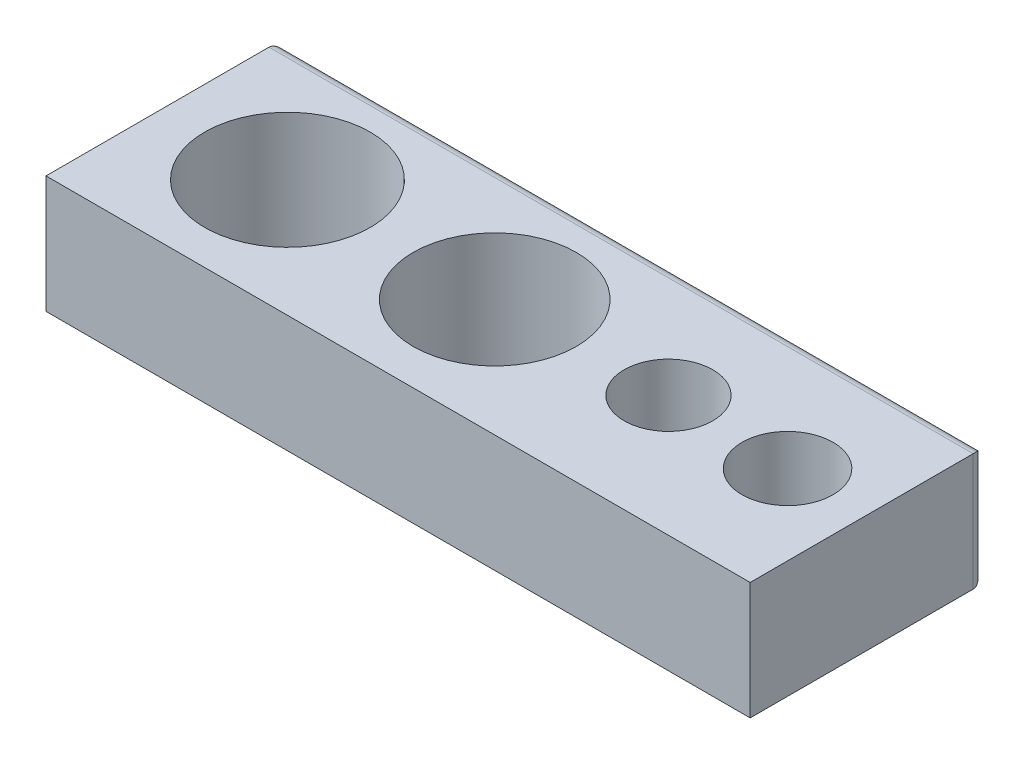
from build123d import *

# Parameters (mm, degrees)
SKETCH1_W           = 30
SKETCH1_H           = 10
BOSS_EXTRUDE1_DEPTH = 5
FILLET1_R           = 0.5
SKETCH2_R           = 3.475
SKETCH2_R_2         = 1.8875
SKETCH2_R_3         = 3.525
SKETCH2_R_4         = 1.9375
CUT_EXTRUDE1_DEPTH  = 5


with BuildPart() as part:
    # Sketch1 → Boss-Extrude1 (new body)
    with BuildSketch(Plane(origin=(0, 0, 0), x_dir=(1, 0, 0), z_dir=(0, 1, 0))):
        Rectangle(SKETCH1_W, SKETCH1_H)
    extrude(amount=BOSS_EXTRUDE1_DEPTH)

    # Fillet1
    fillet1_edges = [part.edges().sort_by_distance(p)[0] for p in [
        (0, 0, -5),
        (0, 5, -5),
        (-15, 2.5, -5),
        (15, 2.5, -5),
    ]]
    fillet(fillet1_edges, radius=FILLET1_R)

    # Sketch2 → Cut-Extrude1 (cut)
    with BuildSketch(Plane.XZ):
        with Locations(Location((-0.882694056, 0, 0), (0, 0, 270))):
            Circle(SKETCH2_R)
        with Locations(Location((6.354068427, -0.165046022, 0), (0, 0, 270))):
            Circle(SKETCH2_R_2)
        with Locations(Location((-9.713045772, 0, 0), (0, 0, 270))):
            Circle(SKETCH2_R_3)
        with Locations(Location((11.593579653, 0, 0), (0, 0, 270))):
            Circle(SKETCH2_R_4)
    extrude(amount=-CUT_EXTRUDE1_DEPTH, mode=Mode.SUBTRACT)


solid = part.part
